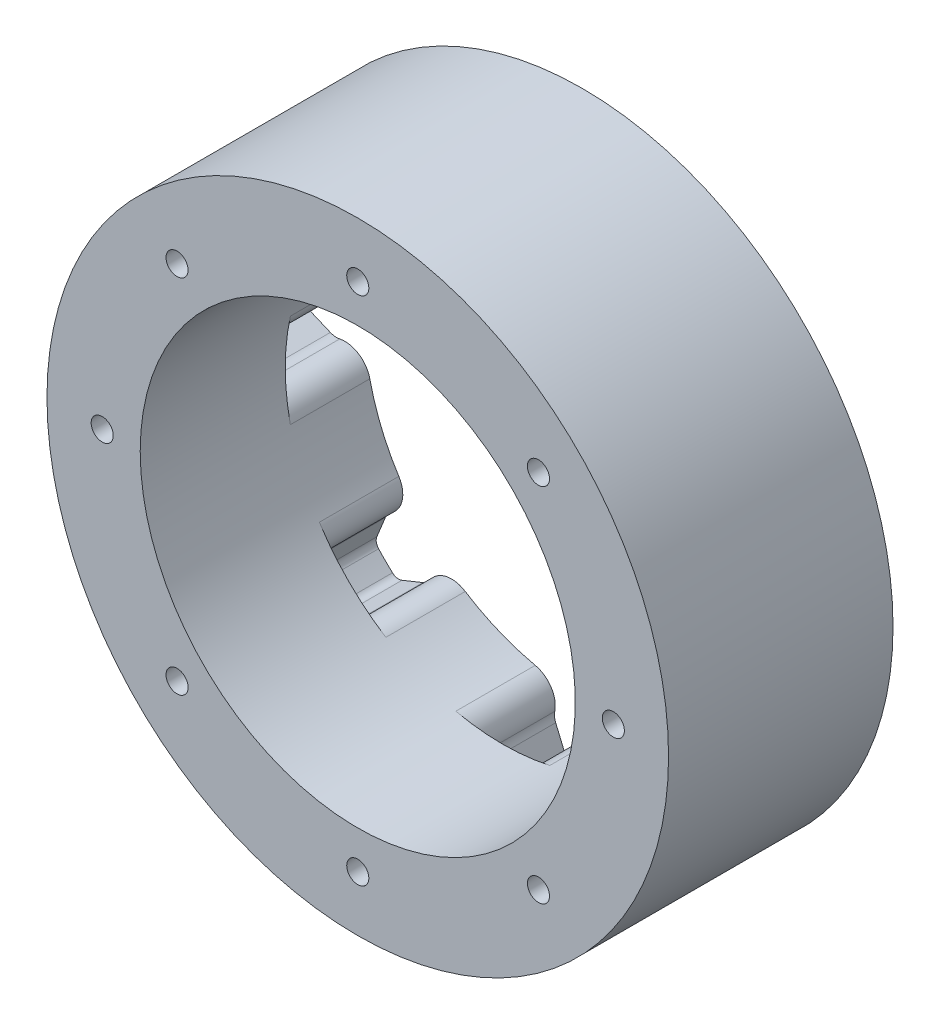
from build123d import *

# Parameters (mm, degrees)
SKETCH1_R           = 45
BOSS_EXTRUDE1_DEPTH = 16.25
CUT_EXTRUDE1_DEPTH  = 11.5
CIRPATTERN1_COUNT   = 8
SKETCH3_R           = 31.5
CUT_EXTRUDE2_DEPTH  = 72.45802964
SKETCH5_R           = 1.6
CUT_EXTRUDE4_DEPTH  = 68.014923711
CIRPATTERN2_COUNT   = 8


with BuildPart() as part:
    # Sketch1 → Boss-Extrude1 (new, symmetric)
    with BuildSketch(Plane(origin=(0, 0, 0), x_dir=(0, 1, 0), z_dir=(0, 0, 1))):
        with Locations(Location((0, 0, 0), (0, 0, 270))):
            Circle(SKETCH1_R)
    extrude(amount=BOSS_EXTRUDE1_DEPTH, both=True)

    # Sketch2 → Cut-Extrude1 (cut)
    with BuildSketch(Plane(origin=(0, 0, -16.25), x_dir=(1, 0, 0), z_dir=(0, 0, -1))):
        with BuildLine():
            Line((2.572221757, 39.48178759), (3.845069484, 36.469685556))
            ThreePointArc((3.845069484, 36.469685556), (4.015258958, 35.801181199), (3.979559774, 35.11227765))
            ThreePointArc((3.979559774, 35.11227765), (4.499845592, 32.35549412), (6.804807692, 30.756212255))
            ThreePointArc((6.804807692, 30.756212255), (0, 31.5), (-6.804807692, 30.756212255))
            ThreePointArc((-6.804807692, 30.756212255), (-4.499845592, 32.35549412), (-3.979559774, 35.11227765))
            ThreePointArc((-3.979559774, 35.11227765), (-4.015258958, 35.801181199), (-3.845069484, 36.469685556))
            Line((-3.845069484, 36.469685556), (-2.572221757, 39.48178759))
            ThreePointArc((-2.572221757, 39.48178759), (-2.112127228, 40.046404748), (-1.420575, 40.274954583))
            ThreePointArc((-1.420575, 40.274954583), (0, 40.3), (1.420575, 40.274954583))
            ThreePointArc((1.420575, 40.274954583), (2.112127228, 40.046404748), (2.572221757, 39.48178759))
        make_face()
    cut_extrude1 = extrude(amount=-CUT_EXTRUDE1_DEPTH, mode=Mode.SUBTRACT)

    # CirPattern1: Cut-Extrude1 ×8 about axis
    cirpattern1_axis = Axis((0, 0, 0), (0, 0, 1))
    for i in range(1, CIRPATTERN1_COUNT):
        add(cut_extrude1.rotate(cirpattern1_axis, i * 360 / CIRPATTERN1_COUNT), mode=Mode.SUBTRACT)

    # Sketch3 → Cut-Extrude2 (cut, through all)
    with BuildSketch(Plane(origin=(0, 0, -16.25), x_dir=(1, 0, 0), z_dir=(0, 0, -1))):
        with Locations(Location((0, 0, 0), (0, 0, 180))):
            Circle(SKETCH3_R)
    extrude(amount=-CUT_EXTRUDE2_DEPTH, mode=Mode.SUBTRACT)

    # Sketch5 → Cut-Extrude4 (cut, through all)
    with BuildSketch(Plane(origin=(0, 0, -4.75), x_dir=(1, 0, 0), z_dir=(0, 0, -1))):
        with Locations(Location((0, 37, 0), (0, 0, 180))):
            Circle(SKETCH5_R)
    cut_extrude4 = extrude(amount=-CUT_EXTRUDE4_DEPTH, mode=Mode.SUBTRACT)

    # CirPattern2: Cut-Extrude4 ×8 about axis
    cirpattern2_axis = Axis((0, 0, 0), (0, 0, 1))
    for i in range(1, CIRPATTERN2_COUNT):
        add(cut_extrude4.rotate(cirpattern2_axis, i * 360 / CIRPATTERN2_COUNT), mode=Mode.SUBTRACT)


solid = part.part
